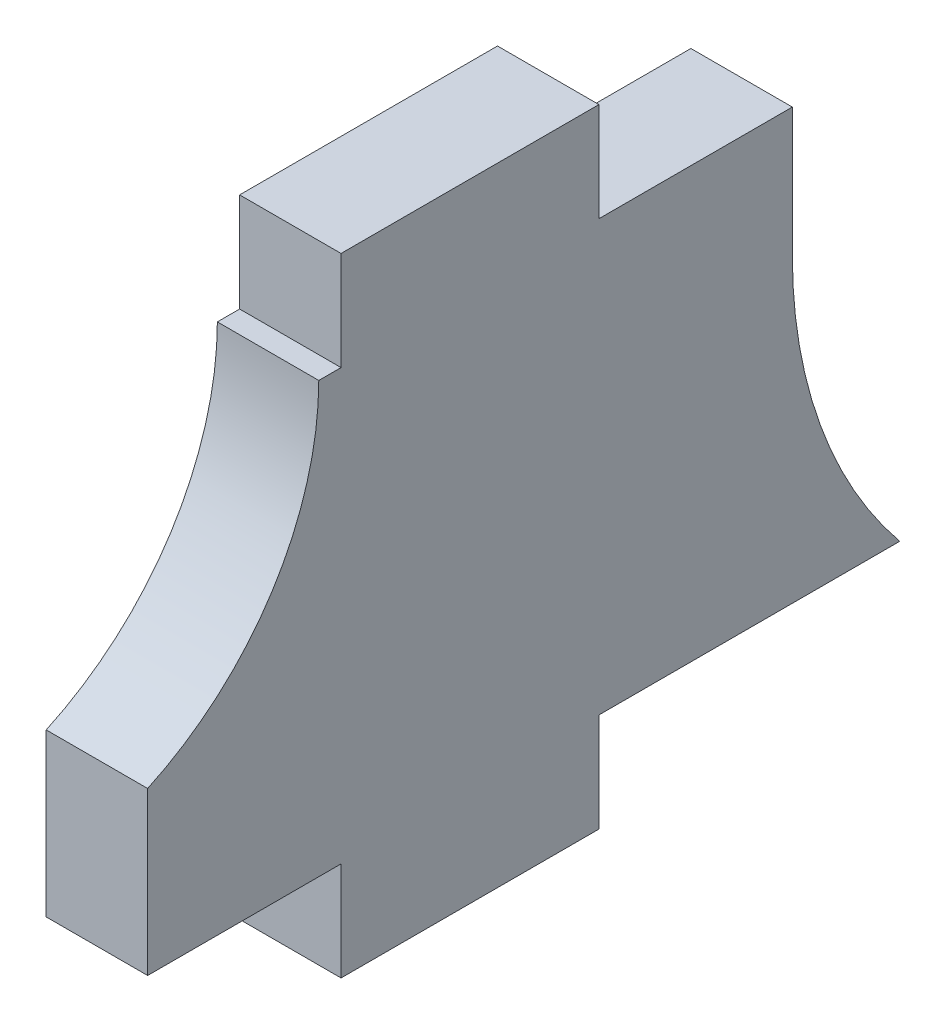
from build123d import *

# Parameters (mm, degrees)
BOSS_EXTRUDE1_DEPTH = 2.9972


with BuildPart() as part:
    # Sketch2 → Boss-Extrude1 (new body)
    with BuildSketch(Plane(origin=(0, 0, 0), x_dir=(0, 0, -1), z_dir=(1, 0, 0))):
        with BuildLine():
            Line((-9.525, 1.4605), (-3.81, 1.4605))
            Line((-3.81, 1.4605), (-3.81, -1.4605))
            Line((-3.81, -1.4605), (3.81, -1.4605))
            Line((3.81, -1.4605), (3.81, 1.4605))
            Line((3.81, 1.4605), (12.7, 1.4605))
            ThreePointArc((12.7, 1.4605), (10.342551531, 5.631924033), (9.525, 10.353147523))
            Line((9.525, 10.353147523), (9.525, 14.1605))
            Line((9.525, 14.1605), (3.81, 14.1605))
            Line((3.81, 14.1605), (3.81, 17.0815))
            Line((3.81, 17.0815), (-3.81, 17.0815))
            Line((-3.81, 17.0815), (-3.81, 14.1605))
            Line((-3.81, 14.1605), (-4.468103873, 14.1605))
            ThreePointArc((-4.468103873, 14.1605), (-5.840288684, 9.464894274), (-9.525, 6.247052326))
            Line((-9.525, 6.247052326), (-9.525, 1.4605))
        make_face()
    extrude(amount=BOSS_EXTRUDE1_DEPTH)


solid = part.part
